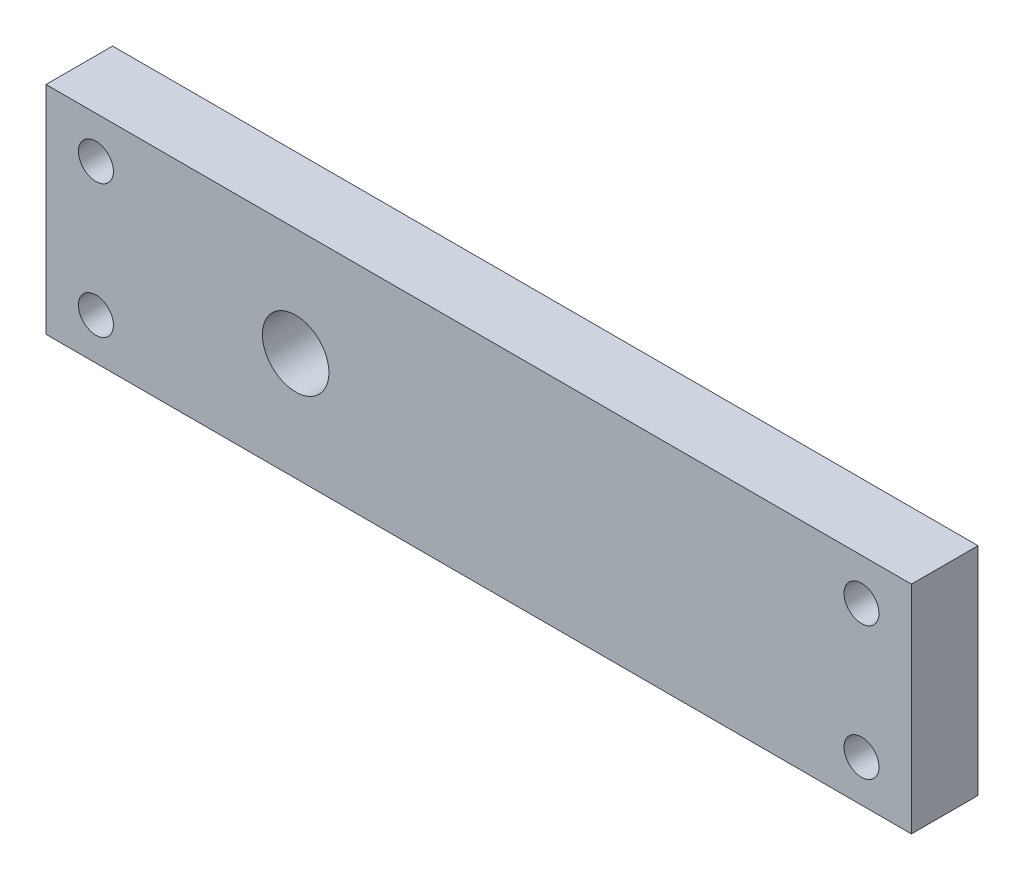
ISO-10303-21;
HEADER;
FILE_DESCRIPTION(('STEP AP214'),'2;1');
FILE_NAME('part.step','',(''),(''),'','','');
FILE_SCHEMA(('AUTOMOTIVE_DESIGN { 1 0 10303 214 1 1 1 1 }'));
ENDSEC;
DATA;
#1=APPLICATION_CONTEXT('core data for automotive mechanical design processes');
#2=APPLICATION_PROTOCOL_DEFINITION('international standard','automotive_design',2000,#1);
#3=PRODUCT_CONTEXT('',#1,'mechanical');
#4=PRODUCT('Part','Part','',(#3));
#5=PRODUCT_RELATED_PRODUCT_CATEGORY('part','',(#4));
#6=PRODUCT_DEFINITION_FORMATION('','',#4);
#7=PRODUCT_DEFINITION_CONTEXT('part definition',#1,'design');
#8=PRODUCT_DEFINITION('design','',#6,#7);
#9=PRODUCT_DEFINITION_SHAPE('','',#8);
#10=(LENGTH_UNIT() NAMED_UNIT(*) SI_UNIT(.MILLI.,.METRE.));
#11=(NAMED_UNIT(*) PLANE_ANGLE_UNIT() SI_UNIT($,.RADIAN.));
#12=(NAMED_UNIT(*) SI_UNIT($,.STERADIAN.) SOLID_ANGLE_UNIT());
#13=UNCERTAINTY_MEASURE_WITH_UNIT(LENGTH_MEASURE(1.E-05),#10,'distance_accuracy_value','');
#14=(GEOMETRIC_REPRESENTATION_CONTEXT(3) GLOBAL_UNCERTAINTY_ASSIGNED_CONTEXT((#13)) GLOBAL_UNIT_ASSIGNED_CONTEXT((#10,
#11,#12)) REPRESENTATION_CONTEXT('',''));
#15=CARTESIAN_POINT('',(0.,0.,0.));
#16=DIRECTION('',(0.,0.,1.));
#17=DIRECTION('',(1.,0.,0.));
#18=AXIS2_PLACEMENT_3D('',#15,#16,#17);
#19=CARTESIAN_POINT('',(0.,26.,0.));
#20=DIRECTION('',(0.,0.,-1.));
#21=DIRECTION('',(-1.,0.,0.));
#22=AXIS2_PLACEMENT_3D('',#19,#20,#21);
#23=PLANE('',#22);
#24=CARTESIAN_POINT('',(6.00000000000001,21.,0.));
#25=DIRECTION('',(0.,0.,1.));
#26=DIRECTION('',(1.,0.,0.));
#27=AXIS2_PLACEMENT_3D('',#24,#25,#26);
#28=CIRCLE('',#27,2.09999999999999);
#29=CARTESIAN_POINT('',(8.10000000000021,21.,0.));
#30=VERTEX_POINT('',#29);
#31=EDGE_CURVE('E134',#30,#30,#28,.T.);
#32=ORIENTED_EDGE('',*,*,#31,.T.);
#33=EDGE_LOOP('',(#32));
#34=FACE_BOUND('',#33,.T.);
#35=CARTESIAN_POINT('',(6.00000000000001,5.00000000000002,0.));
#36=DIRECTION('',(0.,0.,1.));
#37=DIRECTION('',(1.,0.,0.));
#38=AXIS2_PLACEMENT_3D('',#35,#36,#37);
#39=CIRCLE('',#38,2.09999999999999);
#40=CARTESIAN_POINT('',(8.10000000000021,5.,0.));
#41=VERTEX_POINT('',#40);
#42=EDGE_CURVE('E128',#41,#41,#39,.T.);
#43=ORIENTED_EDGE('',*,*,#42,.T.);
#44=EDGE_LOOP('',(#43));
#45=FACE_BOUND('',#44,.T.);
#46=CARTESIAN_POINT('',(98.0000000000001,21.,0.));
#47=DIRECTION('',(0.,0.,1.));
#48=DIRECTION('',(1.,0.,0.));
#49=AXIS2_PLACEMENT_3D('',#46,#47,#48);
#50=CIRCLE('',#49,2.09999999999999);
#51=CARTESIAN_POINT('',(100.1,21.,0.));
#52=VERTEX_POINT('',#51);
#53=EDGE_CURVE('E122',#52,#52,#50,.T.);
#54=ORIENTED_EDGE('',*,*,#53,.T.);
#55=EDGE_LOOP('',(#54));
#56=FACE_BOUND('',#55,.T.);
#57=DIRECTION('',(0.,-1.,0.));
#58=VECTOR('',#57,1.);
#59=CARTESIAN_POINT('',(0.,0.,0.));
#60=LINE('',#59,#58);
#61=CARTESIAN_POINT('',(0.,26.,0.));
#62=VERTEX_POINT('',#61);
#63=CARTESIAN_POINT('',(0.,0.,0.));
#64=VERTEX_POINT('',#63);
#65=EDGE_CURVE('E94',#62,#64,#60,.T.);
#66=ORIENTED_EDGE('',*,*,#65,.F.);
#67=DIRECTION('',(-1.,0.,0.));
#68=VECTOR('',#67,1.);
#69=CARTESIAN_POINT('',(0.,26.,0.));
#70=LINE('',#69,#68);
#71=CARTESIAN_POINT('',(104.,26.,0.));
#72=VERTEX_POINT('',#71);
#73=EDGE_CURVE('E70',#72,#62,#70,.T.);
#74=ORIENTED_EDGE('',*,*,#73,.F.);
#75=DIRECTION('',(0.,1.,0.));
#76=VECTOR('',#75,1.);
#77=CARTESIAN_POINT('',(104.,0.,0.));
#78=LINE('',#77,#76);
#79=CARTESIAN_POINT('',(104.,0.,0.));
#80=VERTEX_POINT('',#79);
#81=EDGE_CURVE('E64',#80,#72,#78,.T.);
#82=ORIENTED_EDGE('',*,*,#81,.F.);
#83=DIRECTION('',(1.,0.,0.));
#84=VECTOR('',#83,1.);
#85=CARTESIAN_POINT('',(0.,0.,0.));
#86=LINE('',#85,#84);
#87=EDGE_CURVE('E86',#64,#80,#86,.T.);
#88=ORIENTED_EDGE('',*,*,#87,.F.);
#89=EDGE_LOOP('',(#66,#74,#82,#88));
#90=FACE_BOUND('',#89,.T.);
#91=CARTESIAN_POINT('',(30.,13.,0.));
#92=DIRECTION('',(0.,0.,1.));
#93=DIRECTION('',(1.,0.,0.));
#94=AXIS2_PLACEMENT_3D('',#91,#92,#93);
#95=CIRCLE('',#94,4.00000000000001);
#96=CARTESIAN_POINT('',(34.,13.,0.));
#97=VERTEX_POINT('',#96);
#98=EDGE_CURVE('E97',#97,#97,#95,.T.);
#99=ORIENTED_EDGE('',*,*,#98,.T.);
#100=EDGE_LOOP('',(#99));
#101=FACE_BOUND('',#100,.T.);
#102=CARTESIAN_POINT('',(98.0000000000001,5.00000000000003,0.));
#103=DIRECTION('',(0.,0.,1.));
#104=DIRECTION('',(1.,0.,0.));
#105=AXIS2_PLACEMENT_3D('',#102,#103,#104);
#106=CIRCLE('',#105,2.09999999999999);
#107=CARTESIAN_POINT('',(100.1,5.00000000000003,0.));
#108=VERTEX_POINT('',#107);
#109=EDGE_CURVE('E116',#108,#108,#106,.T.);
#110=ORIENTED_EDGE('',*,*,#109,.T.);
#111=EDGE_LOOP('',(#110));
#112=FACE_BOUND('',#111,.T.);
#113=ADVANCED_FACE('F30',(#34,#45,#56,#90,#101,#112),#23,.T.);
#114=CARTESIAN_POINT('',(0.,0.,8.));
#115=DIRECTION('',(1.,0.,0.));
#116=DIRECTION('',(0.,0.,-1.));
#117=AXIS2_PLACEMENT_3D('',#114,#115,#116);
#118=PLANE('',#117);
#119=ORIENTED_EDGE('',*,*,#65,.T.);
#120=DIRECTION('',(0.,0.,-1.));
#121=VECTOR('',#120,1.);
#122=CARTESIAN_POINT('',(0.,0.,8.));
#123=LINE('',#122,#121);
#124=CARTESIAN_POINT('',(0.,0.,8.));
#125=VERTEX_POINT('',#124);
#126=EDGE_CURVE('E11',#125,#64,#123,.T.);
#127=ORIENTED_EDGE('',*,*,#126,.F.);
#128=DIRECTION('',(0.,-1.,0.));
#129=VECTOR('',#128,1.);
#130=CARTESIAN_POINT('',(0.,0.,8.));
#131=LINE('',#130,#129);
#132=CARTESIAN_POINT('',(0.,26.,8.));
#133=VERTEX_POINT('',#132);
#134=EDGE_CURVE('E82',#133,#125,#131,.T.);
#135=ORIENTED_EDGE('',*,*,#134,.F.);
#136=DIRECTION('',(0.,0.,-1.));
#137=VECTOR('',#136,1.);
#138=CARTESIAN_POINT('',(0.,26.,8.));
#139=LINE('',#138,#137);
#140=EDGE_CURVE('E90',#133,#62,#139,.T.);
#141=ORIENTED_EDGE('',*,*,#140,.T.);
#142=EDGE_LOOP('',(#119,#127,#135,#141));
#143=FACE_BOUND('',#142,.T.);
#144=ADVANCED_FACE('F32',(#143),#118,.F.);
#145=CARTESIAN_POINT('',(0.,0.,8.));
#146=DIRECTION('',(0.,1.,0.));
#147=DIRECTION('',(0.,0.,1.));
#148=AXIS2_PLACEMENT_3D('',#145,#146,#147);
#149=PLANE('',#148);
#150=ORIENTED_EDGE('',*,*,#87,.T.);
#151=DIRECTION('',(0.,0.,-1.));
#152=VECTOR('',#151,1.);
#153=CARTESIAN_POINT('',(104.,0.,7.99999999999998));
#154=LINE('',#153,#152);
#155=CARTESIAN_POINT('',(104.,0.,7.99999999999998));
#156=VERTEX_POINT('',#155);
#157=EDGE_CURVE('E39',#156,#80,#154,.T.);
#158=ORIENTED_EDGE('',*,*,#157,.F.);
#159=DIRECTION('',(1.,0.,0.));
#160=VECTOR('',#159,1.);
#161=CARTESIAN_POINT('',(0.,0.,8.));
#162=LINE('',#161,#160);
#163=EDGE_CURVE('E77',#125,#156,#162,.T.);
#164=ORIENTED_EDGE('',*,*,#163,.F.);
#165=ORIENTED_EDGE('',*,*,#126,.T.);
#166=EDGE_LOOP('',(#150,#158,#164,#165));
#167=FACE_BOUND('',#166,.T.);
#168=ADVANCED_FACE('F85',(#167),#149,.F.);
#169=CARTESIAN_POINT('',(104.,0.,7.99999999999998));
#170=DIRECTION('',(-1.,0.,0.));
#171=DIRECTION('',(0.,0.,1.));
#172=AXIS2_PLACEMENT_3D('',#169,#170,#171);
#173=PLANE('',#172);
#174=ORIENTED_EDGE('',*,*,#81,.T.);
#175=DIRECTION('',(0.,0.,-1.));
#176=VECTOR('',#175,1.);
#177=CARTESIAN_POINT('',(104.,26.,8.));
#178=LINE('',#177,#176);
#179=CARTESIAN_POINT('',(104.,26.,8.));
#180=VERTEX_POINT('',#179);
#181=EDGE_CURVE('E87',#180,#72,#178,.T.);
#182=ORIENTED_EDGE('',*,*,#181,.F.);
#183=DIRECTION('',(0.,1.,0.));
#184=VECTOR('',#183,1.);
#185=CARTESIAN_POINT('',(104.,0.,7.99999999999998));
#186=LINE('',#185,#184);
#187=EDGE_CURVE('E80',#156,#180,#186,.T.);
#188=ORIENTED_EDGE('',*,*,#187,.F.);
#189=ORIENTED_EDGE('',*,*,#157,.T.);
#190=EDGE_LOOP('',(#174,#182,#188,#189));
#191=FACE_BOUND('',#190,.T.);
#192=ADVANCED_FACE('F88',(#191),#173,.F.);
#193=CARTESIAN_POINT('',(0.,26.,8.));
#194=DIRECTION('',(0.,-1.,0.));
#195=DIRECTION('',(0.,0.,-1.));
#196=AXIS2_PLACEMENT_3D('',#193,#194,#195);
#197=PLANE('',#196);
#198=ORIENTED_EDGE('',*,*,#73,.T.);
#199=ORIENTED_EDGE('',*,*,#140,.F.);
#200=DIRECTION('',(-1.,0.,0.));
#201=VECTOR('',#200,1.);
#202=CARTESIAN_POINT('',(0.,26.,8.));
#203=LINE('',#202,#201);
#204=EDGE_CURVE('E47',#180,#133,#203,.T.);
#205=ORIENTED_EDGE('',*,*,#204,.F.);
#206=ORIENTED_EDGE('',*,*,#181,.T.);
#207=EDGE_LOOP('',(#198,#199,#205,#206));
#208=FACE_BOUND('',#207,.T.);
#209=ADVANCED_FACE('F102',(#208),#197,.F.);
#210=CARTESIAN_POINT('',(0.,26.,8.));
#211=DIRECTION('',(0.,0.,-1.));
#212=DIRECTION('',(-1.,0.,0.));
#213=AXIS2_PLACEMENT_3D('',#210,#211,#212);
#214=PLANE('',#213);
#215=CARTESIAN_POINT('',(6.00000000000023,21.,8.));
#216=DIRECTION('',(0.,0.,1.));
#217=DIRECTION('',(1.,0.,0.));
#218=AXIS2_PLACEMENT_3D('',#215,#216,#217);
#219=CIRCLE('',#218,2.09999999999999);
#220=CARTESIAN_POINT('',(8.10000000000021,21.,8.));
#221=VERTEX_POINT('',#220);
#222=EDGE_CURVE('E131',#221,#221,#219,.T.);
#223=ORIENTED_EDGE('',*,*,#222,.F.);
#224=EDGE_LOOP('',(#223));
#225=FACE_BOUND('',#224,.T.);
#226=CARTESIAN_POINT('',(6.00000000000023,5.,7.99999999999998));
#227=DIRECTION('',(0.,0.,1.));
#228=DIRECTION('',(1.,0.,0.));
#229=AXIS2_PLACEMENT_3D('',#226,#227,#228);
#230=CIRCLE('',#229,2.09999999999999);
#231=CARTESIAN_POINT('',(8.10000000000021,5.,7.99999999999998));
#232=VERTEX_POINT('',#231);
#233=EDGE_CURVE('E125',#232,#232,#230,.T.);
#234=ORIENTED_EDGE('',*,*,#233,.F.);
#235=EDGE_LOOP('',(#234));
#236=FACE_BOUND('',#235,.T.);
#237=CARTESIAN_POINT('',(98.0000000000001,21.,7.99999999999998));
#238=DIRECTION('',(0.,0.,1.));
#239=DIRECTION('',(1.,0.,0.));
#240=AXIS2_PLACEMENT_3D('',#237,#238,#239);
#241=CIRCLE('',#240,2.09999999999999);
#242=CARTESIAN_POINT('',(100.1,21.,7.99999999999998));
#243=VERTEX_POINT('',#242);
#244=EDGE_CURVE('E119',#243,#243,#241,.T.);
#245=ORIENTED_EDGE('',*,*,#244,.F.);
#246=EDGE_LOOP('',(#245));
#247=FACE_BOUND('',#246,.T.);
#248=CARTESIAN_POINT('',(98.0000000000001,5.00000000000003,7.99999999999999));
#249=DIRECTION('',(0.,0.,1.));
#250=DIRECTION('',(1.,0.,0.));
#251=AXIS2_PLACEMENT_3D('',#248,#249,#250);
#252=CIRCLE('',#251,2.09999999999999);
#253=CARTESIAN_POINT('',(100.1,5.00000000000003,7.99999999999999));
#254=VERTEX_POINT('',#253);
#255=EDGE_CURVE('E111',#254,#254,#252,.T.);
#256=ORIENTED_EDGE('',*,*,#255,.F.);
#257=EDGE_LOOP('',(#256));
#258=FACE_BOUND('',#257,.T.);
#259=CARTESIAN_POINT('',(30.,13.,7.99999999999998));
#260=DIRECTION('',(0.,0.,1.));
#261=DIRECTION('',(1.,0.,0.));
#262=AXIS2_PLACEMENT_3D('',#259,#260,#261);
#263=CIRCLE('',#262,4.00000000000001);
#264=CARTESIAN_POINT('',(34.,13.,7.99999999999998));
#265=VERTEX_POINT('',#264);
#266=EDGE_CURVE('E108',#265,#265,#263,.T.);
#267=ORIENTED_EDGE('',*,*,#266,.F.);
#268=EDGE_LOOP('',(#267));
#269=FACE_BOUND('',#268,.T.);
#270=ORIENTED_EDGE('',*,*,#134,.T.);
#271=ORIENTED_EDGE('',*,*,#163,.T.);
#272=ORIENTED_EDGE('',*,*,#187,.T.);
#273=ORIENTED_EDGE('',*,*,#204,.T.);
#274=EDGE_LOOP('',(#270,#271,#272,#273));
#275=FACE_BOUND('',#274,.T.);
#276=ADVANCED_FACE('F78',(#225,#236,#247,#258,#269,#275),#214,.F.);
#277=CARTESIAN_POINT('',(30.,13.,0.));
#278=DIRECTION('',(0.,0.,1.));
#279=DIRECTION('',(1.,0.,0.));
#280=AXIS2_PLACEMENT_3D('',#277,#278,#279);
#281=CYLINDRICAL_SURFACE('',#280,4.00000000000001);
#282=CARTESIAN_POINT('',(34.,13.,0.));
#283=CARTESIAN_POINT('',(34.,13.,0.0833333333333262));
#284=CARTESIAN_POINT('',(34.,13.,0.166666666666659));
#285=CARTESIAN_POINT('',(34.,13.,0.333333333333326));
#286=CARTESIAN_POINT('',(34.,13.,0.416666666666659));
#287=CARTESIAN_POINT('',(34.,13.,0.583333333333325));
#288=CARTESIAN_POINT('',(34.,13.,0.666666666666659));
#289=CARTESIAN_POINT('',(34.,13.,0.833333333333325));
#290=CARTESIAN_POINT('',(34.,13.,0.916666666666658));
#291=CARTESIAN_POINT('',(34.,13.,1.08333333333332));
#292=CARTESIAN_POINT('',(34.,13.,1.16666666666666));
#293=CARTESIAN_POINT('',(34.,13.,1.33333333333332));
#294=CARTESIAN_POINT('',(34.,13.,1.41666666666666));
#295=CARTESIAN_POINT('',(34.,13.,1.58333333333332));
#296=CARTESIAN_POINT('',(34.,13.,1.66666666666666));
#297=CARTESIAN_POINT('',(34.,13.,1.83333333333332));
#298=CARTESIAN_POINT('',(34.,13.,1.91666666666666));
#299=CARTESIAN_POINT('',(34.,13.,2.08333333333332));
#300=CARTESIAN_POINT('',(34.,13.,2.16666666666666));
#301=CARTESIAN_POINT('',(34.,13.,2.33333333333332));
#302=CARTESIAN_POINT('',(34.,13.,2.41666666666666));
#303=CARTESIAN_POINT('',(34.,13.,2.58333333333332));
#304=CARTESIAN_POINT('',(34.,13.,2.66666666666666));
#305=CARTESIAN_POINT('',(34.,13.,2.83333333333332));
#306=CARTESIAN_POINT('',(34.,13.,2.91666666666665));
#307=CARTESIAN_POINT('',(34.,13.,3.08333333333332));
#308=CARTESIAN_POINT('',(34.,13.,3.16666666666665));
#309=CARTESIAN_POINT('',(34.,13.,3.33333333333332));
#310=CARTESIAN_POINT('',(34.,13.,3.41666666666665));
#311=CARTESIAN_POINT('',(34.,13.,3.58333333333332));
#312=CARTESIAN_POINT('',(34.,13.,3.66666666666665));
#313=CARTESIAN_POINT('',(34.,13.,3.83333333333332));
#314=CARTESIAN_POINT('',(34.,13.,3.91666666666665));
#315=CARTESIAN_POINT('',(34.,13.,4.08333333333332));
#316=CARTESIAN_POINT('',(34.,13.,4.16666666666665));
#317=CARTESIAN_POINT('',(34.,13.,4.33333333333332));
#318=CARTESIAN_POINT('',(34.,13.,4.41666666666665));
#319=CARTESIAN_POINT('',(34.,13.,4.58333333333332));
#320=CARTESIAN_POINT('',(34.,13.,4.66666666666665));
#321=CARTESIAN_POINT('',(34.,13.,4.83333333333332));
#322=CARTESIAN_POINT('',(34.,13.,4.91666666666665));
#323=CARTESIAN_POINT('',(34.,13.,5.08333333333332));
#324=CARTESIAN_POINT('',(34.,13.,5.16666666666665));
#325=CARTESIAN_POINT('',(34.,13.,5.33333333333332));
#326=CARTESIAN_POINT('',(34.,13.,5.41666666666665));
#327=CARTESIAN_POINT('',(34.,13.,5.58333333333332));
#328=CARTESIAN_POINT('',(34.,13.,5.66666666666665));
#329=CARTESIAN_POINT('',(34.,13.,5.83333333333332));
#330=CARTESIAN_POINT('',(34.,13.,5.91666666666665));
#331=CARTESIAN_POINT('',(34.,13.,6.08333333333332));
#332=CARTESIAN_POINT('',(34.,13.,6.16666666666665));
#333=CARTESIAN_POINT('',(34.,13.,6.33333333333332));
#334=CARTESIAN_POINT('',(34.,13.,6.41666666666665));
#335=CARTESIAN_POINT('',(34.,13.,6.58333333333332));
#336=CARTESIAN_POINT('',(34.,13.,6.66666666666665));
#337=CARTESIAN_POINT('',(34.,13.,6.83333333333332));
#338=CARTESIAN_POINT('',(34.,13.,6.91666666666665));
#339=CARTESIAN_POINT('',(34.,13.,7.08333333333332));
#340=CARTESIAN_POINT('',(34.,13.,7.16666666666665));
#341=CARTESIAN_POINT('',(34.,13.,7.33333333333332));
#342=CARTESIAN_POINT('',(34.,13.,7.41666666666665));
#343=CARTESIAN_POINT('',(34.,13.,7.58333333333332));
#344=CARTESIAN_POINT('',(34.,13.,7.66666666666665));
#345=CARTESIAN_POINT('',(34.,13.,7.83333333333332));
#346=CARTESIAN_POINT('',(34.,13.,7.91666666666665));
#347=CARTESIAN_POINT('',(34.,13.,7.99999999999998));
#348=B_SPLINE_CURVE_WITH_KNOTS('',3,(#282,#283,#284,#285,#286,#287,#288,#289,#290,#291,#292,
#293,#294,#295,#296,#297,#298,#299,#300,#301,#302,#303,#304,#305,#306,#307,#308,#309,#310,#311,
#312,#313,#314,#315,#316,#317,#318,#319,#320,#321,#322,#323,#324,#325,#326,#327,#328,#329,#330,
#331,#332,#333,#334,#335,#336,#337,#338,#339,#340,#341,#342,#343,#344,#345,#346,#347),
.UNSPECIFIED.,.F.,.F.,(4,2,2,2,2,2,2,2,2,2,2,2,2,2,2,2,2,2,2,2,2,2,2,2,2,2,2,2,2,2,2,2,4),(0.,
0.25,0.499999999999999,0.749999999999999,0.999999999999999,1.25,1.5,1.75,2.,2.25,2.5,2.75,3.,
3.25,3.49999999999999,3.74999999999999,3.99999999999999,4.24999999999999,4.49999999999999,
4.74999999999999,4.99999999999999,5.24999999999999,5.49999999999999,5.74999999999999,
5.99999999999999,6.24999999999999,6.49999999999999,6.74999999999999,6.99999999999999,
7.24999999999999,7.49999999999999,7.74999999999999,7.99999999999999),.UNSPECIFIED.);
#349=EDGE_CURVE('BSEAM149',#97,#265,#348,.T.);
#350=ORIENTED_EDGE('',*,*,#98,.F.);
#351=ORIENTED_EDGE('',*,*,#266,.T.);
#352=ORIENTED_EDGE('',*,*,#349,.T.);
#353=ORIENTED_EDGE('',*,*,#349,.F.);
#354=EDGE_LOOP('',(#350,#352,#351,#353));
#355=FACE_BOUND('',#354,.T.);
#356=ADVANCED_FACE('F149',(#355),#281,.F.);
#357=CARTESIAN_POINT('',(98.0000000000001,5.00000000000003,7.99999999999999));
#358=DIRECTION('',(0.,0.,1.));
#359=DIRECTION('',(1.,0.,0.));
#360=AXIS2_PLACEMENT_3D('',#357,#358,#359);
#361=CYLINDRICAL_SURFACE('',#360,2.09999999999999);
#362=CARTESIAN_POINT('',(100.1,5.00000000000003,0.));
#363=CARTESIAN_POINT('',(100.1,5.00000000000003,0.0833333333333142));
#364=CARTESIAN_POINT('',(100.1,5.00000000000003,0.166666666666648));
#365=CARTESIAN_POINT('',(100.1,5.00000000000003,0.333333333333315));
#366=CARTESIAN_POINT('',(100.1,5.00000000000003,0.416666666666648));
#367=CARTESIAN_POINT('',(100.1,5.00000000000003,0.583333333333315));
#368=CARTESIAN_POINT('',(100.1,5.00000000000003,0.666666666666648));
#369=CARTESIAN_POINT('',(100.1,5.00000000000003,0.833333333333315));
#370=CARTESIAN_POINT('',(100.1,5.00000000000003,0.916666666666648));
#371=CARTESIAN_POINT('',(100.1,5.00000000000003,1.08333333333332));
#372=CARTESIAN_POINT('',(100.1,5.00000000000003,1.16666666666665));
#373=CARTESIAN_POINT('',(100.1,5.00000000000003,1.33333333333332));
#374=CARTESIAN_POINT('',(100.1,5.00000000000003,1.41666666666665));
#375=CARTESIAN_POINT('',(100.1,5.00000000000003,1.58333333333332));
#376=CARTESIAN_POINT('',(100.1,5.00000000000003,1.66666666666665));
#377=CARTESIAN_POINT('',(100.1,5.00000000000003,1.83333333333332));
#378=CARTESIAN_POINT('',(100.1,5.00000000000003,1.91666666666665));
#379=CARTESIAN_POINT('',(100.1,5.00000000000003,2.08333333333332));
#380=CARTESIAN_POINT('',(100.1,5.00000000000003,2.16666666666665));
#381=CARTESIAN_POINT('',(100.1,5.00000000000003,2.33333333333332));
#382=CARTESIAN_POINT('',(100.1,5.00000000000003,2.41666666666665));
#383=CARTESIAN_POINT('',(100.1,5.00000000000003,2.58333333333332));
#384=CARTESIAN_POINT('',(100.1,5.00000000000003,2.66666666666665));
#385=CARTESIAN_POINT('',(100.1,5.00000000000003,2.83333333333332));
#386=CARTESIAN_POINT('',(100.1,5.00000000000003,2.91666666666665));
#387=CARTESIAN_POINT('',(100.1,5.00000000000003,3.08333333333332));
#388=CARTESIAN_POINT('',(100.1,5.00000000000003,3.16666666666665));
#389=CARTESIAN_POINT('',(100.1,5.00000000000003,3.33333333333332));
#390=CARTESIAN_POINT('',(100.1,5.00000000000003,3.41666666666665));
#391=CARTESIAN_POINT('',(100.1,5.00000000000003,3.58333333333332));
#392=CARTESIAN_POINT('',(100.1,5.00000000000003,3.66666666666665));
#393=CARTESIAN_POINT('',(100.1,5.00000000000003,3.83333333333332));
#394=CARTESIAN_POINT('',(100.1,5.00000000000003,3.91666666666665));
#395=CARTESIAN_POINT('',(100.1,5.00000000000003,4.08333333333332));
#396=CARTESIAN_POINT('',(100.1,5.00000000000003,4.16666666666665));
#397=CARTESIAN_POINT('',(100.1,5.00000000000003,4.33333333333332));
#398=CARTESIAN_POINT('',(100.1,5.00000000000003,4.41666666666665));
#399=CARTESIAN_POINT('',(100.1,5.00000000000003,4.58333333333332));
#400=CARTESIAN_POINT('',(100.1,5.00000000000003,4.66666666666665));
#401=CARTESIAN_POINT('',(100.1,5.00000000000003,4.83333333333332));
#402=CARTESIAN_POINT('',(100.1,5.00000000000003,4.91666666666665));
#403=CARTESIAN_POINT('',(100.1,5.00000000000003,5.08333333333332));
#404=CARTESIAN_POINT('',(100.1,5.00000000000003,5.16666666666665));
#405=CARTESIAN_POINT('',(100.1,5.00000000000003,5.33333333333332));
#406=CARTESIAN_POINT('',(100.1,5.00000000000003,5.41666666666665));
#407=CARTESIAN_POINT('',(100.1,5.00000000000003,5.58333333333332));
#408=CARTESIAN_POINT('',(100.1,5.00000000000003,5.66666666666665));
#409=CARTESIAN_POINT('',(100.1,5.00000000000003,5.83333333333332));
#410=CARTESIAN_POINT('',(100.1,5.00000000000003,5.91666666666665));
#411=CARTESIAN_POINT('',(100.1,5.00000000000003,6.08333333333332));
#412=CARTESIAN_POINT('',(100.1,5.00000000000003,6.16666666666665));
#413=CARTESIAN_POINT('',(100.1,5.00000000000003,6.33333333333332));
#414=CARTESIAN_POINT('',(100.1,5.00000000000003,6.41666666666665));
#415=CARTESIAN_POINT('',(100.1,5.00000000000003,6.58333333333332));
#416=CARTESIAN_POINT('',(100.1,5.00000000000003,6.66666666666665));
#417=CARTESIAN_POINT('',(100.1,5.00000000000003,6.83333333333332));
#418=CARTESIAN_POINT('',(100.1,5.00000000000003,6.91666666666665));
#419=CARTESIAN_POINT('',(100.1,5.00000000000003,7.08333333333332));
#420=CARTESIAN_POINT('',(100.1,5.00000000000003,7.16666666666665));
#421=CARTESIAN_POINT('',(100.1,5.00000000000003,7.33333333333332));
#422=CARTESIAN_POINT('',(100.1,5.00000000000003,7.41666666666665));
#423=CARTESIAN_POINT('',(100.1,5.00000000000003,7.58333333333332));
#424=CARTESIAN_POINT('',(100.1,5.00000000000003,7.66666666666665));
#425=CARTESIAN_POINT('',(100.1,5.00000000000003,7.83333333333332));
#426=CARTESIAN_POINT('',(100.1,5.00000000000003,7.91666666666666));
#427=CARTESIAN_POINT('',(100.1,5.00000000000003,7.99999999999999));
#428=B_SPLINE_CURVE_WITH_KNOTS('',3,(#362,#363,#364,#365,#366,#367,#368,#369,#370,#371,#372,
#373,#374,#375,#376,#377,#378,#379,#380,#381,#382,#383,#384,#385,#386,#387,#388,#389,#390,#391,
#392,#393,#394,#395,#396,#397,#398,#399,#400,#401,#402,#403,#404,#405,#406,#407,#408,#409,#410,
#411,#412,#413,#414,#415,#416,#417,#418,#419,#420,#421,#422,#423,#424,#425,#426,#427),
.UNSPECIFIED.,.F.,.F.,(4,2,2,2,2,2,2,2,2,2,2,2,2,2,2,2,2,2,2,2,2,2,2,2,2,2,2,2,2,2,2,2,4),(0.,
0.25,0.5,0.750000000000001,1.,1.25,1.5,1.75,2.,2.25,2.5,2.75,3.,3.25,3.5,3.75,4.,4.25,4.5,4.75,
5.,5.25,5.50000000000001,5.75000000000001,6.00000000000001,6.25000000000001,6.50000000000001,
6.75000000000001,7.00000000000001,7.25000000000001,7.50000000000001,7.75000000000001,
8.00000000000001),.UNSPECIFIED.);
#429=EDGE_CURVE('BSEAM160',#108,#254,#428,.T.);
#430=ORIENTED_EDGE('',*,*,#109,.F.);
#431=ORIENTED_EDGE('',*,*,#255,.T.);
#432=ORIENTED_EDGE('',*,*,#429,.T.);
#433=ORIENTED_EDGE('',*,*,#429,.F.);
#434=EDGE_LOOP('',(#430,#432,#431,#433));
#435=FACE_BOUND('',#434,.T.);
#436=ADVANCED_FACE('F160',(#435),#361,.F.);
#437=CARTESIAN_POINT('',(98.0000000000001,21.,7.99999999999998));
#438=DIRECTION('',(0.,0.,1.));
#439=DIRECTION('',(1.,0.,0.));
#440=AXIS2_PLACEMENT_3D('',#437,#438,#439);
#441=CYLINDRICAL_SURFACE('',#440,2.09999999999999);
#442=CARTESIAN_POINT('',(100.1,21.,0.));
#443=CARTESIAN_POINT('',(100.1,21.,0.0833333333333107));
#444=CARTESIAN_POINT('',(100.1,21.,0.166666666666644));
#445=CARTESIAN_POINT('',(100.1,21.,0.333333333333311));
#446=CARTESIAN_POINT('',(100.1,21.,0.416666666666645));
#447=CARTESIAN_POINT('',(100.1,21.,0.583333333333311));
#448=CARTESIAN_POINT('',(100.1,21.,0.666666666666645));
#449=CARTESIAN_POINT('',(100.1,21.,0.833333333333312));
#450=CARTESIAN_POINT('',(100.1,21.,0.916666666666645));
#451=CARTESIAN_POINT('',(100.1,21.,1.08333333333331));
#452=CARTESIAN_POINT('',(100.1,21.,1.16666666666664));
#453=CARTESIAN_POINT('',(100.1,21.,1.33333333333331));
#454=CARTESIAN_POINT('',(100.1,21.,1.41666666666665));
#455=CARTESIAN_POINT('',(100.1,21.,1.58333333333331));
#456=CARTESIAN_POINT('',(100.1,21.,1.66666666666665));
#457=CARTESIAN_POINT('',(100.1,21.,1.83333333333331));
#458=CARTESIAN_POINT('',(100.1,21.,1.91666666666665));
#459=CARTESIAN_POINT('',(100.1,21.,2.08333333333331));
#460=CARTESIAN_POINT('',(100.1,21.,2.16666666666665));
#461=CARTESIAN_POINT('',(100.1,21.,2.33333333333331));
#462=CARTESIAN_POINT('',(100.1,21.,2.41666666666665));
#463=CARTESIAN_POINT('',(100.1,21.,2.58333333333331));
#464=CARTESIAN_POINT('',(100.1,21.,2.66666666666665));
#465=CARTESIAN_POINT('',(100.1,21.,2.83333333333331));
#466=CARTESIAN_POINT('',(100.1,21.,2.91666666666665));
#467=CARTESIAN_POINT('',(100.1,21.,3.08333333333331));
#468=CARTESIAN_POINT('',(100.1,21.,3.16666666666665));
#469=CARTESIAN_POINT('',(100.1,21.,3.33333333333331));
#470=CARTESIAN_POINT('',(100.1,21.,3.41666666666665));
#471=CARTESIAN_POINT('',(100.1,21.,3.58333333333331));
#472=CARTESIAN_POINT('',(100.1,21.,3.66666666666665));
#473=CARTESIAN_POINT('',(100.1,21.,3.83333333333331));
#474=CARTESIAN_POINT('',(100.1,21.,3.91666666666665));
#475=CARTESIAN_POINT('',(100.1,21.,4.08333333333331));
#476=CARTESIAN_POINT('',(100.1,21.,4.16666666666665));
#477=CARTESIAN_POINT('',(100.1,21.,4.33333333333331));
#478=CARTESIAN_POINT('',(100.1,21.,4.41666666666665));
#479=CARTESIAN_POINT('',(100.1,21.,4.58333333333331));
#480=CARTESIAN_POINT('',(100.1,21.,4.66666666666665));
#481=CARTESIAN_POINT('',(100.1,21.,4.83333333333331));
#482=CARTESIAN_POINT('',(100.1,21.,4.91666666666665));
#483=CARTESIAN_POINT('',(100.1,21.,5.08333333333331));
#484=CARTESIAN_POINT('',(100.1,21.,5.16666666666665));
#485=CARTESIAN_POINT('',(100.1,21.,5.33333333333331));
#486=CARTESIAN_POINT('',(100.1,21.,5.41666666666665));
#487=CARTESIAN_POINT('',(100.1,21.,5.58333333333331));
#488=CARTESIAN_POINT('',(100.1,21.,5.66666666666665));
#489=CARTESIAN_POINT('',(100.1,21.,5.83333333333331));
#490=CARTESIAN_POINT('',(100.1,21.,5.91666666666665));
#491=CARTESIAN_POINT('',(100.1,21.,6.08333333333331));
#492=CARTESIAN_POINT('',(100.1,21.,6.16666666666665));
#493=CARTESIAN_POINT('',(100.1,21.,6.33333333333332));
#494=CARTESIAN_POINT('',(100.1,21.,6.41666666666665));
#495=CARTESIAN_POINT('',(100.1,21.,6.58333333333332));
#496=CARTESIAN_POINT('',(100.1,21.,6.66666666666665));
#497=CARTESIAN_POINT('',(100.1,21.,6.83333333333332));
#498=CARTESIAN_POINT('',(100.1,21.,6.91666666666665));
#499=CARTESIAN_POINT('',(100.1,21.,7.08333333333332));
#500=CARTESIAN_POINT('',(100.1,21.,7.16666666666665));
#501=CARTESIAN_POINT('',(100.1,21.,7.33333333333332));
#502=CARTESIAN_POINT('',(100.1,21.,7.41666666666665));
#503=CARTESIAN_POINT('',(100.1,21.,7.58333333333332));
#504=CARTESIAN_POINT('',(100.1,21.,7.66666666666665));
#505=CARTESIAN_POINT('',(100.1,21.,7.83333333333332));
#506=CARTESIAN_POINT('',(100.1,21.,7.91666666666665));
#507=CARTESIAN_POINT('',(100.1,21.,7.99999999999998));
#508=B_SPLINE_CURVE_WITH_KNOTS('',3,(#442,#443,#444,#445,#446,#447,#448,#449,#450,#451,#452,
#453,#454,#455,#456,#457,#458,#459,#460,#461,#462,#463,#464,#465,#466,#467,#468,#469,#470,#471,
#472,#473,#474,#475,#476,#477,#478,#479,#480,#481,#482,#483,#484,#485,#486,#487,#488,#489,#490,
#491,#492,#493,#494,#495,#496,#497,#498,#499,#500,#501,#502,#503,#504,#505,#506,#507),
.UNSPECIFIED.,.F.,.F.,(4,2,2,2,2,2,2,2,2,2,2,2,2,2,2,2,2,2,2,2,2,2,2,2,2,2,2,2,2,2,2,2,4),(0.,
0.25,0.5,0.750000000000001,1.,1.25,1.5,1.75,2.,2.25,2.5,2.75,3.,3.25,3.5,3.75,4.,4.25,4.5,4.75,
5.,5.25,5.5,5.75,6.,6.25,6.5,6.75,7.,7.25,7.50000000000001,7.75000000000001,8.00000000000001),.UNSPECIFIED.);
#509=EDGE_CURVE('BSEAM166',#52,#243,#508,.T.);
#510=ORIENTED_EDGE('',*,*,#53,.F.);
#511=ORIENTED_EDGE('',*,*,#244,.T.);
#512=ORIENTED_EDGE('',*,*,#509,.T.);
#513=ORIENTED_EDGE('',*,*,#509,.F.);
#514=EDGE_LOOP('',(#510,#512,#511,#513));
#515=FACE_BOUND('',#514,.T.);
#516=ADVANCED_FACE('F166',(#515),#441,.F.);
#517=CARTESIAN_POINT('',(6.00000000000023,5.,7.99999999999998));
#518=DIRECTION('',(0.,0.,1.));
#519=DIRECTION('',(1.,0.,0.));
#520=AXIS2_PLACEMENT_3D('',#517,#518,#519);
#521=CYLINDRICAL_SURFACE('',#520,2.09999999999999);
#522=CARTESIAN_POINT('',(8.10000000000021,5.,0.));
#523=CARTESIAN_POINT('',(8.10000000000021,5.,0.0833333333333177));
#524=CARTESIAN_POINT('',(8.10000000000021,5.,0.166666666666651));
#525=CARTESIAN_POINT('',(8.10000000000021,5.,0.333333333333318));
#526=CARTESIAN_POINT('',(8.10000000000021,5.,0.416666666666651));
#527=CARTESIAN_POINT('',(8.10000000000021,5.,0.583333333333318));
#528=CARTESIAN_POINT('',(8.10000000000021,5.,0.666666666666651));
#529=CARTESIAN_POINT('',(8.10000000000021,5.,0.833333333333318));
#530=CARTESIAN_POINT('',(8.10000000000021,5.,0.916666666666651));
#531=CARTESIAN_POINT('',(8.10000000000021,5.,1.08333333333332));
#532=CARTESIAN_POINT('',(8.10000000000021,5.,1.16666666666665));
#533=CARTESIAN_POINT('',(8.10000000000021,5.,1.33333333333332));
#534=CARTESIAN_POINT('',(8.10000000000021,5.,1.41666666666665));
#535=CARTESIAN_POINT('',(8.10000000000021,5.,1.58333333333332));
#536=CARTESIAN_POINT('',(8.10000000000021,5.,1.66666666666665));
#537=CARTESIAN_POINT('',(8.10000000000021,5.,1.83333333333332));
#538=CARTESIAN_POINT('',(8.10000000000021,5.,1.91666666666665));
#539=CARTESIAN_POINT('',(8.10000000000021,5.,2.08333333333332));
#540=CARTESIAN_POINT('',(8.10000000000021,5.,2.16666666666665));
#541=CARTESIAN_POINT('',(8.10000000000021,5.,2.33333333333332));
#542=CARTESIAN_POINT('',(8.10000000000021,5.,2.41666666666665));
#543=CARTESIAN_POINT('',(8.10000000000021,5.,2.58333333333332));
#544=CARTESIAN_POINT('',(8.10000000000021,5.,2.66666666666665));
#545=CARTESIAN_POINT('',(8.10000000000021,5.,2.83333333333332));
#546=CARTESIAN_POINT('',(8.10000000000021,5.,2.91666666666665));
#547=CARTESIAN_POINT('',(8.10000000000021,5.,3.08333333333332));
#548=CARTESIAN_POINT('',(8.10000000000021,5.,3.16666666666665));
#549=CARTESIAN_POINT('',(8.10000000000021,5.,3.33333333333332));
#550=CARTESIAN_POINT('',(8.10000000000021,5.,3.41666666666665));
#551=CARTESIAN_POINT('',(8.10000000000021,5.,3.58333333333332));
#552=CARTESIAN_POINT('',(8.10000000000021,5.,3.66666666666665));
#553=CARTESIAN_POINT('',(8.10000000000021,5.,3.83333333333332));
#554=CARTESIAN_POINT('',(8.10000000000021,5.,3.91666666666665));
#555=CARTESIAN_POINT('',(8.10000000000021,5.,4.08333333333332));
#556=CARTESIAN_POINT('',(8.10000000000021,5.,4.16666666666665));
#557=CARTESIAN_POINT('',(8.10000000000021,5.,4.33333333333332));
#558=CARTESIAN_POINT('',(8.10000000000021,5.,4.41666666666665));
#559=CARTESIAN_POINT('',(8.10000000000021,5.,4.58333333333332));
#560=CARTESIAN_POINT('',(8.10000000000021,5.,4.66666666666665));
#561=CARTESIAN_POINT('',(8.10000000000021,5.,4.83333333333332));
#562=CARTESIAN_POINT('',(8.10000000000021,5.,4.91666666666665));
#563=CARTESIAN_POINT('',(8.10000000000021,5.,5.08333333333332));
#564=CARTESIAN_POINT('',(8.10000000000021,5.,5.16666666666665));
#565=CARTESIAN_POINT('',(8.10000000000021,5.,5.33333333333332));
#566=CARTESIAN_POINT('',(8.10000000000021,5.,5.41666666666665));
#567=CARTESIAN_POINT('',(8.10000000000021,5.,5.58333333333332));
#568=CARTESIAN_POINT('',(8.10000000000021,5.,5.66666666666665));
#569=CARTESIAN_POINT('',(8.10000000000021,5.,5.83333333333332));
#570=CARTESIAN_POINT('',(8.10000000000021,5.,5.91666666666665));
#571=CARTESIAN_POINT('',(8.10000000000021,5.,6.08333333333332));
#572=CARTESIAN_POINT('',(8.10000000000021,5.,6.16666666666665));
#573=CARTESIAN_POINT('',(8.10000000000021,5.,6.33333333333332));
#574=CARTESIAN_POINT('',(8.10000000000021,5.,6.41666666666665));
#575=CARTESIAN_POINT('',(8.10000000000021,5.,6.58333333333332));
#576=CARTESIAN_POINT('',(8.10000000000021,5.,6.66666666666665));
#577=CARTESIAN_POINT('',(8.10000000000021,5.,6.83333333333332));
#578=CARTESIAN_POINT('',(8.10000000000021,5.,6.91666666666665));
#579=CARTESIAN_POINT('',(8.10000000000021,5.,7.08333333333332));
#580=CARTESIAN_POINT('',(8.10000000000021,5.,7.16666666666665));
#581=CARTESIAN_POINT('',(8.10000000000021,5.,7.33333333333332));
#582=CARTESIAN_POINT('',(8.10000000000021,5.,7.41666666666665));
#583=CARTESIAN_POINT('',(8.10000000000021,5.,7.58333333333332));
#584=CARTESIAN_POINT('',(8.10000000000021,5.,7.66666666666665));
#585=CARTESIAN_POINT('',(8.10000000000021,5.,7.83333333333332));
#586=CARTESIAN_POINT('',(8.10000000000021,5.,7.91666666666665));
#587=CARTESIAN_POINT('',(8.10000000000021,5.,7.99999999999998));
#588=B_SPLINE_CURVE_WITH_KNOTS('',3,(#522,#523,#524,#525,#526,#527,#528,#529,#530,#531,#532,
#533,#534,#535,#536,#537,#538,#539,#540,#541,#542,#543,#544,#545,#546,#547,#548,#549,#550,#551,
#552,#553,#554,#555,#556,#557,#558,#559,#560,#561,#562,#563,#564,#565,#566,#567,#568,#569,#570,
#571,#572,#573,#574,#575,#576,#577,#578,#579,#580,#581,#582,#583,#584,#585,#586,#587),
.UNSPECIFIED.,.F.,.F.,(4,2,2,2,2,2,2,2,2,2,2,2,2,2,2,2,2,2,2,2,2,2,2,2,2,2,2,2,2,2,2,2,4),(0.,
0.25,0.5,0.75,1.,1.25,1.5,1.75,2.,2.25,2.5,2.75,3.,3.25,3.5,3.75,4.,4.25,4.5,4.75,5.,5.25,5.5,
5.75,6.,6.25,6.5,6.75,7.,7.25,7.5,7.75,8.),.UNSPECIFIED.);
#589=EDGE_CURVE('BSEAM143',#41,#232,#588,.T.);
#590=ORIENTED_EDGE('',*,*,#42,.F.);
#591=ORIENTED_EDGE('',*,*,#233,.T.);
#592=ORIENTED_EDGE('',*,*,#589,.T.);
#593=ORIENTED_EDGE('',*,*,#589,.F.);
#594=EDGE_LOOP('',(#590,#592,#591,#593));
#595=FACE_BOUND('',#594,.T.);
#596=ADVANCED_FACE('F143',(#595),#521,.F.);
#597=CARTESIAN_POINT('',(6.00000000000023,21.,8.));
#598=DIRECTION('',(0.,0.,1.));
#599=DIRECTION('',(1.,0.,0.));
#600=AXIS2_PLACEMENT_3D('',#597,#598,#599);
#601=CYLINDRICAL_SURFACE('',#600,2.09999999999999);
#602=CARTESIAN_POINT('',(8.10000000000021,21.,0.));
#603=CARTESIAN_POINT('',(8.10000000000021,21.,0.0833333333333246));
#604=CARTESIAN_POINT('',(8.10000000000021,21.,0.166666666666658));
#605=CARTESIAN_POINT('',(8.10000000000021,21.,0.333333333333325));
#606=CARTESIAN_POINT('',(8.10000000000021,21.,0.416666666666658));
#607=CARTESIAN_POINT('',(8.10000000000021,21.,0.583333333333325));
#608=CARTESIAN_POINT('',(8.10000000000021,21.,0.666666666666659));
#609=CARTESIAN_POINT('',(8.10000000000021,21.,0.833333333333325));
#610=CARTESIAN_POINT('',(8.10000000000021,21.,0.916666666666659));
#611=CARTESIAN_POINT('',(8.10000000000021,21.,1.08333333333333));
#612=CARTESIAN_POINT('',(8.10000000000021,21.,1.16666666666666));
#613=CARTESIAN_POINT('',(8.10000000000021,21.,1.33333333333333));
#614=CARTESIAN_POINT('',(8.10000000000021,21.,1.41666666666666));
#615=CARTESIAN_POINT('',(8.10000000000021,21.,1.58333333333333));
#616=CARTESIAN_POINT('',(8.10000000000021,21.,1.66666666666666));
#617=CARTESIAN_POINT('',(8.10000000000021,21.,1.83333333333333));
#618=CARTESIAN_POINT('',(8.10000000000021,21.,1.91666666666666));
#619=CARTESIAN_POINT('',(8.10000000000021,21.,2.08333333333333));
#620=CARTESIAN_POINT('',(8.10000000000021,21.,2.16666666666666));
#621=CARTESIAN_POINT('',(8.10000000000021,21.,2.33333333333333));
#622=CARTESIAN_POINT('',(8.10000000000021,21.,2.41666666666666));
#623=CARTESIAN_POINT('',(8.10000000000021,21.,2.58333333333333));
#624=CARTESIAN_POINT('',(8.10000000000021,21.,2.66666666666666));
#625=CARTESIAN_POINT('',(8.10000000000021,21.,2.83333333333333));
#626=CARTESIAN_POINT('',(8.10000000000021,21.,2.91666666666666));
#627=CARTESIAN_POINT('',(8.10000000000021,21.,3.08333333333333));
#628=CARTESIAN_POINT('',(8.10000000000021,21.,3.16666666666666));
#629=CARTESIAN_POINT('',(8.10000000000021,21.,3.33333333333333));
#630=CARTESIAN_POINT('',(8.10000000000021,21.,3.41666666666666));
#631=CARTESIAN_POINT('',(8.10000000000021,21.,3.58333333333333));
#632=CARTESIAN_POINT('',(8.10000000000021,21.,3.66666666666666));
#633=CARTESIAN_POINT('',(8.10000000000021,21.,3.83333333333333));
#634=CARTESIAN_POINT('',(8.10000000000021,21.,3.91666666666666));
#635=CARTESIAN_POINT('',(8.10000000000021,21.,4.08333333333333));
#636=CARTESIAN_POINT('',(8.10000000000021,21.,4.16666666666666));
#637=CARTESIAN_POINT('',(8.10000000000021,21.,4.33333333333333));
#638=CARTESIAN_POINT('',(8.10000000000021,21.,4.41666666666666));
#639=CARTESIAN_POINT('',(8.10000000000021,21.,4.58333333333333));
#640=CARTESIAN_POINT('',(8.10000000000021,21.,4.66666666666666));
#641=CARTESIAN_POINT('',(8.10000000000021,21.,4.83333333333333));
#642=CARTESIAN_POINT('',(8.10000000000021,21.,4.91666666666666));
#643=CARTESIAN_POINT('',(8.10000000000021,21.,5.08333333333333));
#644=CARTESIAN_POINT('',(8.10000000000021,21.,5.16666666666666));
#645=CARTESIAN_POINT('',(8.10000000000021,21.,5.33333333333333));
#646=CARTESIAN_POINT('',(8.10000000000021,21.,5.41666666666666));
#647=CARTESIAN_POINT('',(8.10000000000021,21.,5.58333333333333));
#648=CARTESIAN_POINT('',(8.10000000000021,21.,5.66666666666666));
#649=CARTESIAN_POINT('',(8.10000000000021,21.,5.83333333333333));
#650=CARTESIAN_POINT('',(8.10000000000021,21.,5.91666666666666));
#651=CARTESIAN_POINT('',(8.10000000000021,21.,6.08333333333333));
#652=CARTESIAN_POINT('',(8.10000000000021,21.,6.16666666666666));
#653=CARTESIAN_POINT('',(8.10000000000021,21.,6.33333333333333));
#654=CARTESIAN_POINT('',(8.10000000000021,21.,6.41666666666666));
#655=CARTESIAN_POINT('',(8.10000000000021,21.,6.58333333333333));
#656=CARTESIAN_POINT('',(8.10000000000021,21.,6.66666666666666));
#657=CARTESIAN_POINT('',(8.10000000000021,21.,6.83333333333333));
#658=CARTESIAN_POINT('',(8.10000000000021,21.,6.91666666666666));
#659=CARTESIAN_POINT('',(8.10000000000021,21.,7.08333333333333));
#660=CARTESIAN_POINT('',(8.10000000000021,21.,7.16666666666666));
#661=CARTESIAN_POINT('',(8.10000000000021,21.,7.33333333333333));
#662=CARTESIAN_POINT('',(8.10000000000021,21.,7.41666666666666));
#663=CARTESIAN_POINT('',(8.10000000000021,21.,7.58333333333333));
#664=CARTESIAN_POINT('',(8.10000000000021,21.,7.66666666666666));
#665=CARTESIAN_POINT('',(8.10000000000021,21.,7.83333333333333));
#666=CARTESIAN_POINT('',(8.10000000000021,21.,7.91666666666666));
#667=CARTESIAN_POINT('',(8.10000000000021,21.,8.));
#668=B_SPLINE_CURVE_WITH_KNOTS('',3,(#602,#603,#604,#605,#606,#607,#608,#609,#610,#611,#612,
#613,#614,#615,#616,#617,#618,#619,#620,#621,#622,#623,#624,#625,#626,#627,#628,#629,#630,#631,
#632,#633,#634,#635,#636,#637,#638,#639,#640,#641,#642,#643,#644,#645,#646,#647,#648,#649,#650,
#651,#652,#653,#654,#655,#656,#657,#658,#659,#660,#661,#662,#663,#664,#665,#666,#667),
.UNSPECIFIED.,.F.,.F.,(4,2,2,2,2,2,2,2,2,2,2,2,2,2,2,2,2,2,2,2,2,2,2,2,2,2,2,2,2,2,2,2,4),(0.,
0.25,0.5,0.750000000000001,1.,1.25,1.5,1.75,2.,2.25,2.5,2.75,3.,3.25,3.5,3.75,4.,4.25,4.5,4.75,
5.,5.25,5.5,5.75,6.,6.25,6.5,6.75,7.,7.25,7.50000000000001,7.75000000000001,8.00000000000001),.UNSPECIFIED.);
#669=EDGE_CURVE('BSEAM140',#30,#221,#668,.T.);
#670=ORIENTED_EDGE('',*,*,#31,.F.);
#671=ORIENTED_EDGE('',*,*,#222,.T.);
#672=ORIENTED_EDGE('',*,*,#669,.T.);
#673=ORIENTED_EDGE('',*,*,#669,.F.);
#674=EDGE_LOOP('',(#670,#672,#671,#673));
#675=FACE_BOUND('',#674,.T.);
#676=ADVANCED_FACE('F140',(#675),#601,.F.);
#677=CLOSED_SHELL('',(#113,#144,#168,#192,#209,#276,#356,#436,#516,#596,#676));
#678=MANIFOLD_SOLID_BREP('B2',#677);
#679=ADVANCED_BREP_SHAPE_REPRESENTATION('',(#18,#678),#14);
#680=SHAPE_DEFINITION_REPRESENTATION(#9,#679);
ENDSEC;
END-ISO-10303-21;
